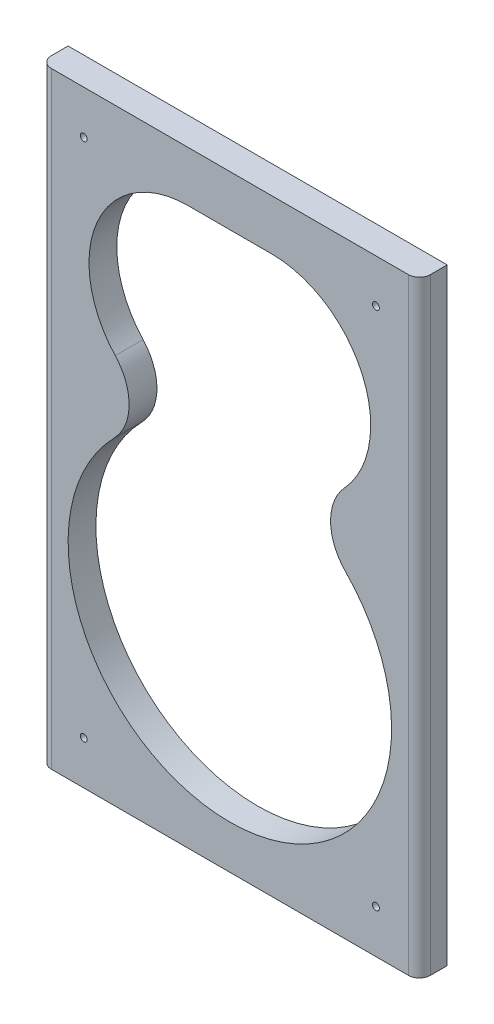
ISO-10303-21;
HEADER;
FILE_DESCRIPTION(('STEP AP214'),'2;1');
FILE_NAME('part.step','',(''),(''),'','','');
FILE_SCHEMA(('AUTOMOTIVE_DESIGN { 1 0 10303 214 1 1 1 1 }'));
ENDSEC;
DATA;
#1=APPLICATION_CONTEXT('core data for automotive mechanical design processes');
#2=APPLICATION_PROTOCOL_DEFINITION('international standard','automotive_design',2000,#1);
#3=PRODUCT_CONTEXT('',#1,'mechanical');
#4=PRODUCT('Part','Part','',(#3));
#5=PRODUCT_RELATED_PRODUCT_CATEGORY('part','',(#4));
#6=PRODUCT_DEFINITION_FORMATION('','',#4);
#7=PRODUCT_DEFINITION_CONTEXT('part definition',#1,'design');
#8=PRODUCT_DEFINITION('design','',#6,#7);
#9=PRODUCT_DEFINITION_SHAPE('','',#8);
#10=(LENGTH_UNIT() NAMED_UNIT(*) SI_UNIT(.MILLI.,.METRE.));
#11=(NAMED_UNIT(*) PLANE_ANGLE_UNIT() SI_UNIT($,.RADIAN.));
#12=(NAMED_UNIT(*) SI_UNIT($,.STERADIAN.) SOLID_ANGLE_UNIT());
#13=UNCERTAINTY_MEASURE_WITH_UNIT(LENGTH_MEASURE(1.E-05),#10,'distance_accuracy_value','');
#14=(GEOMETRIC_REPRESENTATION_CONTEXT(3) GLOBAL_UNCERTAINTY_ASSIGNED_CONTEXT((#13)) GLOBAL_UNIT_ASSIGNED_CONTEXT((#10,
#11,#12)) REPRESENTATION_CONTEXT('',''));
#15=CARTESIAN_POINT('',(0.,0.,0.));
#16=DIRECTION('',(0.,0.,1.));
#17=DIRECTION('',(1.,0.,0.));
#18=AXIS2_PLACEMENT_3D('',#15,#16,#17);
#19=CARTESIAN_POINT('',(11.,365.,16.));
#20=DIRECTION('',(0.,0.,-1.));
#21=DIRECTION('',(-1.,0.,0.));
#22=AXIS2_PLACEMENT_3D('',#19,#20,#21);
#23=PLANE('',#22);
#24=CARTESIAN_POINT('',(36.,41.0000000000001,16.));
#25=DIRECTION('',(0.,0.,-1.));
#26=DIRECTION('',(-1.,0.,0.));
#27=AXIS2_PLACEMENT_3D('',#24,#25,#26);
#28=CIRCLE('',#27,2.);
#29=CARTESIAN_POINT('',(34.,41.0000000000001,16.));
#30=VERTEX_POINT('',#29);
#31=EDGE_CURVE('E298',#30,#30,#28,.T.);
#32=ORIENTED_EDGE('',*,*,#31,.T.);
#33=EDGE_LOOP('',(#32));
#34=FACE_BOUND('',#33,.T.);
#35=CARTESIAN_POINT('',(204.,41.0000000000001,16.));
#36=DIRECTION('',(0.,0.,-1.));
#37=DIRECTION('',(-1.,0.,0.));
#38=AXIS2_PLACEMENT_3D('',#35,#36,#37);
#39=CIRCLE('',#38,2.);
#40=CARTESIAN_POINT('',(202.,41.0000000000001,16.));
#41=VERTEX_POINT('',#40);
#42=EDGE_CURVE('E306',#41,#41,#39,.T.);
#43=ORIENTED_EDGE('',*,*,#42,.T.);
#44=EDGE_LOOP('',(#43));
#45=FACE_BOUND('',#44,.T.);
#46=CARTESIAN_POINT('',(36.,340.,16.));
#47=DIRECTION('',(0.,0.,-1.));
#48=DIRECTION('',(-1.,0.,0.));
#49=AXIS2_PLACEMENT_3D('',#46,#47,#48);
#50=CIRCLE('',#49,2.);
#51=CARTESIAN_POINT('',(34.,340.,16.));
#52=VERTEX_POINT('',#51);
#53=EDGE_CURVE('E312',#52,#52,#50,.T.);
#54=ORIENTED_EDGE('',*,*,#53,.T.);
#55=EDGE_LOOP('',(#54));
#56=FACE_BOUND('',#55,.T.);
#57=CARTESIAN_POINT('',(204.,340.,16.));
#58=DIRECTION('',(0.,0.,-1.));
#59=DIRECTION('',(-1.,0.,0.));
#60=AXIS2_PLACEMENT_3D('',#57,#58,#59);
#61=CIRCLE('',#60,2.);
#62=CARTESIAN_POINT('',(202.,340.,16.));
#63=VERTEX_POINT('',#62);
#64=EDGE_CURVE('E158',#63,#63,#61,.T.);
#65=ORIENTED_EDGE('',*,*,#64,.T.);
#66=EDGE_LOOP('',(#65));
#67=FACE_BOUND('',#66,.T.);
#68=DIRECTION('',(-1.,0.,0.));
#69=VECTOR('',#68,1.);
#70=CARTESIAN_POINT('',(11.,365.,16.));
#71=LINE('',#70,#69);
#72=CARTESIAN_POINT('',(222.65,365.,16.));
#73=VERTEX_POINT('',#72);
#74=CARTESIAN_POINT('',(17.35,365.,16.));
#75=VERTEX_POINT('',#74);
#76=EDGE_CURVE('E182',#73,#75,#71,.T.);
#77=ORIENTED_EDGE('',*,*,#76,.T.);
#78=DIRECTION('',(0.,-1.,0.));
#79=VECTOR('',#78,1.);
#80=CARTESIAN_POINT('',(17.35,365.,16.));
#81=LINE('',#80,#79);
#82=CARTESIAN_POINT('',(17.35,16.0000000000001,16.));
#83=VERTEX_POINT('',#82);
#84=EDGE_CURVE('E207',#75,#83,#81,.T.);
#85=ORIENTED_EDGE('',*,*,#84,.T.);
#86=DIRECTION('',(1.,0.,0.));
#87=VECTOR('',#86,1.);
#88=CARTESIAN_POINT('',(229.,16.0000000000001,16.));
#89=LINE('',#88,#87);
#90=CARTESIAN_POINT('',(222.65,16.0000000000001,16.));
#91=VERTEX_POINT('',#90);
#92=EDGE_CURVE('E179',#83,#91,#89,.T.);
#93=ORIENTED_EDGE('',*,*,#92,.T.);
#94=DIRECTION('',(0.,1.,0.));
#95=VECTOR('',#94,1.);
#96=CARTESIAN_POINT('',(222.65,365.,16.));
#97=LINE('',#96,#95);
#98=EDGE_CURVE('E204',#91,#73,#97,.T.);
#99=ORIENTED_EDGE('',*,*,#98,.T.);
#100=EDGE_LOOP('',(#77,#85,#93,#99));
#101=FACE_BOUND('',#100,.T.);
#102=CARTESIAN_POINT('',(120.,134.002673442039,16.));
#103=DIRECTION('',(0.,0.,1.));
#104=DIRECTION('',(1.,0.,0.));
#105=AXIS2_PLACEMENT_3D('',#102,#103,#104);
#106=CIRCLE('',#105,93.);
#107=CARTESIAN_POINT('',(53.5106907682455,199.027067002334,16.));
#108=VERTEX_POINT('',#107);
#109=CARTESIAN_POINT('',(186.489309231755,199.027067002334,16.));
#110=VERTEX_POINT('',#109);
#111=EDGE_CURVE('E121',#108,#110,#106,.T.);
#112=ORIENTED_EDGE('',*,*,#111,.F.);
#113=CARTESIAN_POINT('',(32.0625264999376,220.002677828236,16.));
#114=DIRECTION('',(0.,0.,-1.));
#115=DIRECTION('',(1.,0.,0.));
#116=AXIS2_PLACEMENT_3D('',#113,#114,#115);
#117=CIRCLE('',#116,30.);
#118=CARTESIAN_POINT('',(54.1099311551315,240.347503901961,16.));
#119=VERTEX_POINT('',#118);
#120=EDGE_CURVE('E154',#119,#108,#117,.T.);
#121=ORIENTED_EDGE('',*,*,#120,.F.);
#122=CARTESIAN_POINT('',(96.,279.002673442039,16.));
#123=DIRECTION('',(0.,0.,1.));
#124=DIRECTION('',(1.,0.,0.));
#125=AXIS2_PLACEMENT_3D('',#122,#123,#124);
#126=CIRCLE('',#125,57.);
#127=CARTESIAN_POINT('',(96.,336.002673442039,16.));
#128=VERTEX_POINT('',#127);
#129=EDGE_CURVE('E151',#128,#119,#126,.T.);
#130=ORIENTED_EDGE('',*,*,#129,.F.);
#131=DIRECTION('',(-1.,0.,0.));
#132=VECTOR('',#131,1.);
#133=CARTESIAN_POINT('',(96.,336.002673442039,16.));
#134=LINE('',#133,#132);
#135=CARTESIAN_POINT('',(144.,336.002673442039,16.));
#136=VERTEX_POINT('',#135);
#137=EDGE_CURVE('E146',#136,#128,#134,.T.);
#138=ORIENTED_EDGE('',*,*,#137,.F.);
#139=CARTESIAN_POINT('',(144.,279.002673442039,16.));
#140=DIRECTION('',(0.,0.,1.));
#141=DIRECTION('',(1.,0.,0.));
#142=AXIS2_PLACEMENT_3D('',#139,#140,#141);
#143=CIRCLE('',#142,57.);
#144=CARTESIAN_POINT('',(185.890068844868,240.347503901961,16.));
#145=VERTEX_POINT('',#144);
#146=EDGE_CURVE('E144',#145,#136,#143,.T.);
#147=ORIENTED_EDGE('',*,*,#146,.F.);
#148=CARTESIAN_POINT('',(207.937473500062,220.002677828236,16.));
#149=DIRECTION('',(0.,0.,-1.));
#150=DIRECTION('',(-1.,0.,0.));
#151=AXIS2_PLACEMENT_3D('',#148,#149,#150);
#152=CIRCLE('',#151,30.);
#153=EDGE_CURVE('E131',#110,#145,#152,.T.);
#154=ORIENTED_EDGE('',*,*,#153,.F.);
#155=EDGE_LOOP('',(#112,#121,#130,#138,#147,#154));
#156=FACE_BOUND('',#155,.T.);
#157=ADVANCED_FACE('F31',(#34,#45,#56,#67,#101,#156),#23,.F.);
#158=CARTESIAN_POINT('',(11.,365.,0.));
#159=DIRECTION('',(0.,0.,-1.));
#160=DIRECTION('',(-1.,0.,0.));
#161=AXIS2_PLACEMENT_3D('',#158,#159,#160);
#162=PLANE('',#161);
#163=CARTESIAN_POINT('',(36.,41.0000000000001,0.));
#164=DIRECTION('',(0.,0.,-1.));
#165=DIRECTION('',(-1.,0.,0.));
#166=AXIS2_PLACEMENT_3D('',#163,#164,#165);
#167=CIRCLE('',#166,2.);
#168=CARTESIAN_POINT('',(34.,41.0000000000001,0.));
#169=VERTEX_POINT('',#168);
#170=EDGE_CURVE('E301',#169,#169,#167,.T.);
#171=ORIENTED_EDGE('',*,*,#170,.F.);
#172=EDGE_LOOP('',(#171));
#173=FACE_BOUND('',#172,.T.);
#174=CARTESIAN_POINT('',(204.,41.0000000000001,0.));
#175=DIRECTION('',(0.,0.,-1.));
#176=DIRECTION('',(-1.,0.,0.));
#177=AXIS2_PLACEMENT_3D('',#174,#175,#176);
#178=CIRCLE('',#177,2.);
#179=CARTESIAN_POINT('',(202.,41.0000000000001,0.));
#180=VERTEX_POINT('',#179);
#181=EDGE_CURVE('E303',#180,#180,#178,.T.);
#182=ORIENTED_EDGE('',*,*,#181,.F.);
#183=EDGE_LOOP('',(#182));
#184=FACE_BOUND('',#183,.T.);
#185=CARTESIAN_POINT('',(36.,340.,0.));
#186=DIRECTION('',(0.,0.,-1.));
#187=DIRECTION('',(-1.,0.,0.));
#188=AXIS2_PLACEMENT_3D('',#185,#186,#187);
#189=CIRCLE('',#188,2.);
#190=CARTESIAN_POINT('',(34.,340.,0.));
#191=VERTEX_POINT('',#190);
#192=EDGE_CURVE('E309',#191,#191,#189,.T.);
#193=ORIENTED_EDGE('',*,*,#192,.F.);
#194=EDGE_LOOP('',(#193));
#195=FACE_BOUND('',#194,.T.);
#196=CARTESIAN_POINT('',(204.,340.,0.));
#197=DIRECTION('',(0.,0.,-1.));
#198=DIRECTION('',(-1.,0.,0.));
#199=AXIS2_PLACEMENT_3D('',#196,#197,#198);
#200=CIRCLE('',#199,2.);
#201=CARTESIAN_POINT('',(202.,340.,0.));
#202=VERTEX_POINT('',#201);
#203=EDGE_CURVE('E315',#202,#202,#200,.T.);
#204=ORIENTED_EDGE('',*,*,#203,.F.);
#205=EDGE_LOOP('',(#204));
#206=FACE_BOUND('',#205,.T.);
#207=DIRECTION('',(0.,-1.,0.));
#208=VECTOR('',#207,1.);
#209=CARTESIAN_POINT('',(11.,16.0000000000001,0.));
#210=LINE('',#209,#208);
#211=CARTESIAN_POINT('',(11.,365.,0.));
#212=VERTEX_POINT('',#211);
#213=CARTESIAN_POINT('',(11.,16.0000000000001,0.));
#214=VERTEX_POINT('',#213);
#215=EDGE_CURVE('E139',#212,#214,#210,.T.);
#216=ORIENTED_EDGE('',*,*,#215,.F.);
#217=DIRECTION('',(-1.,0.,0.));
#218=VECTOR('',#217,1.);
#219=CARTESIAN_POINT('',(11.,365.,0.));
#220=LINE('',#219,#218);
#221=CARTESIAN_POINT('',(229.,365.,0.));
#222=VERTEX_POINT('',#221);
#223=EDGE_CURVE('E183',#222,#212,#220,.T.);
#224=ORIENTED_EDGE('',*,*,#223,.F.);
#225=DIRECTION('',(0.,1.,0.));
#226=VECTOR('',#225,1.);
#227=CARTESIAN_POINT('',(229.,365.,0.));
#228=LINE('',#227,#226);
#229=CARTESIAN_POINT('',(229.,16.0000000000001,0.));
#230=VERTEX_POINT('',#229);
#231=EDGE_CURVE('E192',#230,#222,#228,.T.);
#232=ORIENTED_EDGE('',*,*,#231,.F.);
#233=DIRECTION('',(1.,0.,0.));
#234=VECTOR('',#233,1.);
#235=CARTESIAN_POINT('',(229.,16.0000000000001,0.));
#236=LINE('',#235,#234);
#237=EDGE_CURVE('E189',#214,#230,#236,.T.);
#238=ORIENTED_EDGE('',*,*,#237,.F.);
#239=EDGE_LOOP('',(#216,#224,#232,#238));
#240=FACE_BOUND('',#239,.T.);
#241=CARTESIAN_POINT('',(32.0625264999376,220.002677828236,0.));
#242=DIRECTION('',(0.,0.,-1.));
#243=DIRECTION('',(1.,0.,0.));
#244=AXIS2_PLACEMENT_3D('',#241,#242,#243);
#245=CIRCLE('',#244,30.);
#246=CARTESIAN_POINT('',(54.1099311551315,240.347503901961,0.));
#247=VERTEX_POINT('',#246);
#248=CARTESIAN_POINT('',(53.5106907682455,199.027067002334,0.));
#249=VERTEX_POINT('',#248);
#250=EDGE_CURVE('E132',#247,#249,#245,.T.);
#251=ORIENTED_EDGE('',*,*,#250,.T.);
#252=CARTESIAN_POINT('',(120.,134.002673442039,0.));
#253=DIRECTION('',(0.,0.,1.));
#254=DIRECTION('',(1.,0.,0.));
#255=AXIS2_PLACEMENT_3D('',#252,#253,#254);
#256=CIRCLE('',#255,93.);
#257=CARTESIAN_POINT('',(186.489309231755,199.027067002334,0.));
#258=VERTEX_POINT('',#257);
#259=EDGE_CURVE('E156',#249,#258,#256,.T.);
#260=ORIENTED_EDGE('',*,*,#259,.T.);
#261=CARTESIAN_POINT('',(207.937473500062,220.002677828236,0.));
#262=DIRECTION('',(0.,0.,-1.));
#263=DIRECTION('',(-1.,0.,0.));
#264=AXIS2_PLACEMENT_3D('',#261,#262,#263);
#265=CIRCLE('',#264,30.);
#266=CARTESIAN_POINT('',(185.890068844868,240.347503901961,0.));
#267=VERTEX_POINT('',#266);
#268=EDGE_CURVE('E138',#258,#267,#265,.T.);
#269=ORIENTED_EDGE('',*,*,#268,.T.);
#270=CARTESIAN_POINT('',(144.,279.002673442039,0.));
#271=DIRECTION('',(0.,0.,1.));
#272=DIRECTION('',(1.,0.,0.));
#273=AXIS2_PLACEMENT_3D('',#270,#271,#272);
#274=CIRCLE('',#273,57.);
#275=CARTESIAN_POINT('',(144.,336.002673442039,0.));
#276=VERTEX_POINT('',#275);
#277=EDGE_CURVE('E160',#267,#276,#274,.T.);
#278=ORIENTED_EDGE('',*,*,#277,.T.);
#279=DIRECTION('',(-1.,0.,0.));
#280=VECTOR('',#279,1.);
#281=CARTESIAN_POINT('',(96.,336.002673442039,0.));
#282=LINE('',#281,#280);
#283=CARTESIAN_POINT('',(96.,336.002673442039,0.));
#284=VERTEX_POINT('',#283);
#285=EDGE_CURVE('E163',#276,#284,#282,.T.);
#286=ORIENTED_EDGE('',*,*,#285,.T.);
#287=CARTESIAN_POINT('',(96.,279.002673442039,0.));
#288=DIRECTION('',(0.,0.,1.));
#289=DIRECTION('',(1.,0.,0.));
#290=AXIS2_PLACEMENT_3D('',#287,#288,#289);
#291=CIRCLE('',#290,57.);
#292=EDGE_CURVE('E166',#284,#247,#291,.T.);
#293=ORIENTED_EDGE('',*,*,#292,.T.);
#294=EDGE_LOOP('',(#251,#260,#269,#278,#286,#293));
#295=FACE_BOUND('',#294,.T.);
#296=ADVANCED_FACE('F230',(#173,#184,#195,#206,#240,#295),#162,.T.);
#297=CARTESIAN_POINT('',(11.,16.0000000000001,16.));
#298=DIRECTION('',(1.,0.,0.));
#299=DIRECTION('',(0.,0.,-1.));
#300=AXIS2_PLACEMENT_3D('',#297,#298,#299);
#301=PLANE('',#300);
#302=DIRECTION('',(0.,0.,-1.));
#303=VECTOR('',#302,1.);
#304=CARTESIAN_POINT('',(11.,16.0000000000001,16.));
#305=LINE('',#304,#303);
#306=CARTESIAN_POINT('',(11.,16.0000000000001,9.65));
#307=VERTEX_POINT('',#306);
#308=EDGE_CURVE('E202',#307,#214,#305,.T.);
#309=ORIENTED_EDGE('',*,*,#308,.F.);
#310=DIRECTION('',(0.,-1.,0.));
#311=VECTOR('',#310,1.);
#312=CARTESIAN_POINT('',(11.,16.0000000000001,9.65));
#313=LINE('',#312,#311);
#314=CARTESIAN_POINT('',(11.,365.,9.65));
#315=VERTEX_POINT('',#314);
#316=EDGE_CURVE('E54',#307,#315,#313,.F.);
#317=ORIENTED_EDGE('',*,*,#316,.T.);
#318=DIRECTION('',(0.,0.,-1.));
#319=VECTOR('',#318,1.);
#320=CARTESIAN_POINT('',(11.,365.,16.));
#321=LINE('',#320,#319);
#322=EDGE_CURVE('E186',#315,#212,#321,.T.);
#323=ORIENTED_EDGE('',*,*,#322,.T.);
#324=ORIENTED_EDGE('',*,*,#215,.T.);
#325=EDGE_LOOP('',(#309,#317,#323,#324));
#326=FACE_BOUND('',#325,.T.);
#327=ADVANCED_FACE('F226',(#326),#301,.F.);
#328=CARTESIAN_POINT('',(229.,16.0000000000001,16.));
#329=DIRECTION('',(0.,1.,0.));
#330=DIRECTION('',(0.,0.,1.));
#331=AXIS2_PLACEMENT_3D('',#328,#329,#330);
#332=PLANE('',#331);
#333=ORIENTED_EDGE('',*,*,#92,.F.);
#334=CARTESIAN_POINT('',(17.35,16.0000000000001,9.65));
#335=DIRECTION('',(0.,1.,0.));
#336=DIRECTION('',(0.,0.,1.));
#337=AXIS2_PLACEMENT_3D('',#334,#335,#336);
#338=CIRCLE('',#337,6.35);
#339=EDGE_CURVE('E212',#83,#307,#338,.F.);
#340=ORIENTED_EDGE('',*,*,#339,.T.);
#341=ORIENTED_EDGE('',*,*,#308,.T.);
#342=ORIENTED_EDGE('',*,*,#237,.T.);
#343=DIRECTION('',(0.,0.,-1.));
#344=VECTOR('',#343,1.);
#345=CARTESIAN_POINT('',(229.,16.0000000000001,16.));
#346=LINE('',#345,#344);
#347=CARTESIAN_POINT('',(229.,16.0000000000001,9.65));
#348=VERTEX_POINT('',#347);
#349=EDGE_CURVE('E200',#348,#230,#346,.T.);
#350=ORIENTED_EDGE('',*,*,#349,.F.);
#351=CARTESIAN_POINT('',(222.65,16.0000000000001,9.65));
#352=DIRECTION('',(0.,1.,0.));
#353=DIRECTION('',(0.,0.,1.));
#354=AXIS2_PLACEMENT_3D('',#351,#352,#353);
#355=CIRCLE('',#354,6.35);
#356=EDGE_CURVE('E210',#348,#91,#355,.F.);
#357=ORIENTED_EDGE('',*,*,#356,.T.);
#358=EDGE_LOOP('',(#333,#340,#341,#342,#350,#357));
#359=FACE_BOUND('',#358,.T.);
#360=ADVANCED_FACE('F224',(#359),#332,.F.);
#361=CARTESIAN_POINT('',(229.,365.,16.));
#362=DIRECTION('',(-1.,0.,0.));
#363=DIRECTION('',(0.,0.,1.));
#364=AXIS2_PLACEMENT_3D('',#361,#362,#363);
#365=PLANE('',#364);
#366=DIRECTION('',(0.,0.,-1.));
#367=VECTOR('',#366,1.);
#368=CARTESIAN_POINT('',(229.,365.,16.));
#369=LINE('',#368,#367);
#370=CARTESIAN_POINT('',(229.,365.,9.65));
#371=VERTEX_POINT('',#370);
#372=EDGE_CURVE('E198',#371,#222,#369,.T.);
#373=ORIENTED_EDGE('',*,*,#372,.F.);
#374=DIRECTION('',(0.,1.,0.));
#375=VECTOR('',#374,1.);
#376=CARTESIAN_POINT('',(229.,365.,9.65));
#377=LINE('',#376,#375);
#378=EDGE_CURVE('E11',#371,#348,#377,.F.);
#379=ORIENTED_EDGE('',*,*,#378,.T.);
#380=ORIENTED_EDGE('',*,*,#349,.T.);
#381=ORIENTED_EDGE('',*,*,#231,.T.);
#382=EDGE_LOOP('',(#373,#379,#380,#381));
#383=FACE_BOUND('',#382,.T.);
#384=ADVANCED_FACE('F238',(#383),#365,.F.);
#385=CARTESIAN_POINT('',(11.,365.,16.));
#386=DIRECTION('',(0.,-1.,0.));
#387=DIRECTION('',(0.,0.,-1.));
#388=AXIS2_PLACEMENT_3D('',#385,#386,#387);
#389=PLANE('',#388);
#390=ORIENTED_EDGE('',*,*,#322,.F.);
#391=CARTESIAN_POINT('',(17.35,365.,9.65));
#392=DIRECTION('',(0.,-1.,0.));
#393=DIRECTION('',(0.,0.,-1.));
#394=AXIS2_PLACEMENT_3D('',#391,#392,#393);
#395=CIRCLE('',#394,6.35);
#396=EDGE_CURVE('E39',#315,#75,#395,.F.);
#397=ORIENTED_EDGE('',*,*,#396,.T.);
#398=ORIENTED_EDGE('',*,*,#76,.F.);
#399=CARTESIAN_POINT('',(222.65,365.,9.65));
#400=DIRECTION('',(0.,-1.,0.));
#401=DIRECTION('',(0.,0.,-1.));
#402=AXIS2_PLACEMENT_3D('',#399,#400,#401);
#403=CIRCLE('',#402,6.35);
#404=EDGE_CURVE('E46',#73,#371,#403,.F.);
#405=ORIENTED_EDGE('',*,*,#404,.T.);
#406=ORIENTED_EDGE('',*,*,#372,.T.);
#407=ORIENTED_EDGE('',*,*,#223,.T.);
#408=EDGE_LOOP('',(#390,#397,#398,#405,#406,#407));
#409=FACE_BOUND('',#408,.T.);
#410=ADVANCED_FACE('F216',(#409),#389,.F.);
#411=CARTESIAN_POINT('',(120.,134.002673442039,16.));
#412=DIRECTION('',(0.,0.,-1.));
#413=DIRECTION('',(-1.,0.,0.));
#414=AXIS2_PLACEMENT_3D('',#411,#412,#413);
#415=CYLINDRICAL_SURFACE('',#414,93.);
#416=ORIENTED_EDGE('',*,*,#259,.F.);
#417=DIRECTION('',(0.,0.,-1.));
#418=VECTOR('',#417,1.);
#419=CARTESIAN_POINT('',(53.5106907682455,199.027067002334,16.));
#420=LINE('',#419,#418);
#421=EDGE_CURVE('E127',#108,#249,#420,.T.);
#422=ORIENTED_EDGE('',*,*,#421,.F.);
#423=ORIENTED_EDGE('',*,*,#111,.T.);
#424=DIRECTION('',(0.,0.,-1.));
#425=VECTOR('',#424,1.);
#426=CARTESIAN_POINT('',(186.489309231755,199.027067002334,16.));
#427=LINE('',#426,#425);
#428=EDGE_CURVE('E124',#110,#258,#427,.T.);
#429=ORIENTED_EDGE('',*,*,#428,.T.);
#430=EDGE_LOOP('',(#416,#422,#423,#429));
#431=FACE_BOUND('',#430,.T.);
#432=ADVANCED_FACE('F123',(#431),#415,.F.);
#433=CARTESIAN_POINT('',(207.937473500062,220.002677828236,16.));
#434=DIRECTION('',(0.,0.,-1.));
#435=DIRECTION('',(-1.,0.,0.));
#436=AXIS2_PLACEMENT_3D('',#433,#434,#435);
#437=CYLINDRICAL_SURFACE('',#436,30.);
#438=ORIENTED_EDGE('',*,*,#268,.F.);
#439=ORIENTED_EDGE('',*,*,#428,.F.);
#440=ORIENTED_EDGE('',*,*,#153,.T.);
#441=DIRECTION('',(0.,0.,-1.));
#442=VECTOR('',#441,1.);
#443=CARTESIAN_POINT('',(185.890068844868,240.347503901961,16.));
#444=LINE('',#443,#442);
#445=EDGE_CURVE('E140',#145,#267,#444,.T.);
#446=ORIENTED_EDGE('',*,*,#445,.T.);
#447=EDGE_LOOP('',(#438,#439,#440,#446));
#448=FACE_BOUND('',#447,.T.);
#449=ADVANCED_FACE('F135',(#448),#437,.T.);
#450=CARTESIAN_POINT('',(144.,279.002673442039,16.));
#451=DIRECTION('',(0.,0.,-1.));
#452=DIRECTION('',(-1.,0.,0.));
#453=AXIS2_PLACEMENT_3D('',#450,#451,#452);
#454=CYLINDRICAL_SURFACE('',#453,57.);
#455=ORIENTED_EDGE('',*,*,#277,.F.);
#456=ORIENTED_EDGE('',*,*,#445,.F.);
#457=ORIENTED_EDGE('',*,*,#146,.T.);
#458=DIRECTION('',(0.,0.,-1.));
#459=VECTOR('',#458,1.);
#460=CARTESIAN_POINT('',(144.,336.002673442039,16.));
#461=LINE('',#460,#459);
#462=EDGE_CURVE('E176',#136,#276,#461,.T.);
#463=ORIENTED_EDGE('',*,*,#462,.T.);
#464=EDGE_LOOP('',(#455,#456,#457,#463));
#465=FACE_BOUND('',#464,.T.);
#466=ADVANCED_FACE('F263',(#465),#454,.F.);
#467=CARTESIAN_POINT('',(96.,336.002673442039,16.));
#468=DIRECTION('',(0.,-1.,0.));
#469=DIRECTION('',(0.,0.,-1.));
#470=AXIS2_PLACEMENT_3D('',#467,#468,#469);
#471=PLANE('',#470);
#472=ORIENTED_EDGE('',*,*,#285,.F.);
#473=ORIENTED_EDGE('',*,*,#462,.F.);
#474=ORIENTED_EDGE('',*,*,#137,.T.);
#475=DIRECTION('',(0.,0.,-1.));
#476=VECTOR('',#475,1.);
#477=CARTESIAN_POINT('',(96.,336.002673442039,16.));
#478=LINE('',#477,#476);
#479=EDGE_CURVE('E174',#128,#284,#478,.T.);
#480=ORIENTED_EDGE('',*,*,#479,.T.);
#481=EDGE_LOOP('',(#472,#473,#474,#480));
#482=FACE_BOUND('',#481,.T.);
#483=ADVANCED_FACE('F266',(#482),#471,.T.);
#484=CARTESIAN_POINT('',(96.,279.002673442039,16.));
#485=DIRECTION('',(0.,0.,-1.));
#486=DIRECTION('',(-1.,0.,0.));
#487=AXIS2_PLACEMENT_3D('',#484,#485,#486);
#488=CYLINDRICAL_SURFACE('',#487,57.);
#489=ORIENTED_EDGE('',*,*,#292,.F.);
#490=ORIENTED_EDGE('',*,*,#479,.F.);
#491=ORIENTED_EDGE('',*,*,#129,.T.);
#492=DIRECTION('',(0.,0.,-1.));
#493=VECTOR('',#492,1.);
#494=CARTESIAN_POINT('',(54.1099311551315,240.347503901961,16.));
#495=LINE('',#494,#493);
#496=EDGE_CURVE('E172',#119,#247,#495,.T.);
#497=ORIENTED_EDGE('',*,*,#496,.T.);
#498=EDGE_LOOP('',(#489,#490,#491,#497));
#499=FACE_BOUND('',#498,.T.);
#500=ADVANCED_FACE('F270',(#499),#488,.F.);
#501=CARTESIAN_POINT('',(32.0625264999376,220.002677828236,16.));
#502=DIRECTION('',(0.,0.,-1.));
#503=DIRECTION('',(-1.,0.,0.));
#504=AXIS2_PLACEMENT_3D('',#501,#502,#503);
#505=CYLINDRICAL_SURFACE('',#504,30.);
#506=ORIENTED_EDGE('',*,*,#250,.F.);
#507=ORIENTED_EDGE('',*,*,#496,.F.);
#508=ORIENTED_EDGE('',*,*,#120,.T.);
#509=ORIENTED_EDGE('',*,*,#421,.T.);
#510=EDGE_LOOP('',(#506,#507,#508,#509));
#511=FACE_BOUND('',#510,.T.);
#512=ADVANCED_FACE('F274',(#511),#505,.T.);
#513=CARTESIAN_POINT('',(17.35,365.,9.65));
#514=DIRECTION('',(0.,-1.,0.));
#515=DIRECTION('',(0.,0.,-1.));
#516=AXIS2_PLACEMENT_3D('',#513,#514,#515);
#517=CYLINDRICAL_SURFACE('',#516,6.35);
#518=ORIENTED_EDGE('',*,*,#396,.F.);
#519=ORIENTED_EDGE('',*,*,#316,.F.);
#520=ORIENTED_EDGE('',*,*,#339,.F.);
#521=ORIENTED_EDGE('',*,*,#84,.F.);
#522=EDGE_LOOP('',(#518,#519,#520,#521));
#523=FACE_BOUND('',#522,.T.);
#524=ADVANCED_FACE('F222',(#523),#517,.T.);
#525=CARTESIAN_POINT('',(222.65,365.,9.65));
#526=DIRECTION('',(0.,1.,0.));
#527=DIRECTION('',(0.,0.,1.));
#528=AXIS2_PLACEMENT_3D('',#525,#526,#527);
#529=CYLINDRICAL_SURFACE('',#528,6.35);
#530=ORIENTED_EDGE('',*,*,#356,.F.);
#531=ORIENTED_EDGE('',*,*,#378,.F.);
#532=ORIENTED_EDGE('',*,*,#404,.F.);
#533=ORIENTED_EDGE('',*,*,#98,.F.);
#534=EDGE_LOOP('',(#530,#531,#532,#533));
#535=FACE_BOUND('',#534,.T.);
#536=ADVANCED_FACE('F33',(#535),#529,.T.);
#537=CARTESIAN_POINT('',(204.,340.,16.));
#538=DIRECTION('',(0.,0.,-1.));
#539=DIRECTION('',(-1.,0.,0.));
#540=AXIS2_PLACEMENT_3D('',#537,#538,#539);
#541=CYLINDRICAL_SURFACE('',#540,2.);
#542=ORIENTED_EDGE('',*,*,#64,.F.);
#543=EDGE_LOOP('',(#542));
#544=FACE_BOUND('',#543,.T.);
#545=ORIENTED_EDGE('',*,*,#203,.T.);
#546=EDGE_LOOP('',(#545));
#547=FACE_BOUND('',#546,.T.);
#548=ADVANCED_FACE('F279',(#544,#547),#541,.F.);
#549=CARTESIAN_POINT('',(36.,340.,16.));
#550=DIRECTION('',(0.,0.,-1.));
#551=DIRECTION('',(-1.,0.,0.));
#552=AXIS2_PLACEMENT_3D('',#549,#550,#551);
#553=CYLINDRICAL_SURFACE('',#552,2.);
#554=ORIENTED_EDGE('',*,*,#53,.F.);
#555=EDGE_LOOP('',(#554));
#556=FACE_BOUND('',#555,.T.);
#557=ORIENTED_EDGE('',*,*,#192,.T.);
#558=EDGE_LOOP('',(#557));
#559=FACE_BOUND('',#558,.T.);
#560=ADVANCED_FACE('F282',(#556,#559),#553,.F.);
#561=CARTESIAN_POINT('',(204.,41.0000000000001,16.));
#562=DIRECTION('',(0.,0.,-1.));
#563=DIRECTION('',(-1.,0.,0.));
#564=AXIS2_PLACEMENT_3D('',#561,#562,#563);
#565=CYLINDRICAL_SURFACE('',#564,2.);
#566=ORIENTED_EDGE('',*,*,#42,.F.);
#567=EDGE_LOOP('',(#566));
#568=FACE_BOUND('',#567,.T.);
#569=ORIENTED_EDGE('',*,*,#181,.T.);
#570=EDGE_LOOP('',(#569));
#571=FACE_BOUND('',#570,.T.);
#572=ADVANCED_FACE('F286',(#568,#571),#565,.F.);
#573=CARTESIAN_POINT('',(36.,41.0000000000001,16.));
#574=DIRECTION('',(0.,0.,-1.));
#575=DIRECTION('',(-1.,0.,0.));
#576=AXIS2_PLACEMENT_3D('',#573,#574,#575);
#577=CYLINDRICAL_SURFACE('',#576,2.);
#578=ORIENTED_EDGE('',*,*,#31,.F.);
#579=EDGE_LOOP('',(#578));
#580=FACE_BOUND('',#579,.T.);
#581=ORIENTED_EDGE('',*,*,#170,.T.);
#582=EDGE_LOOP('',(#581));
#583=FACE_BOUND('',#582,.T.);
#584=ADVANCED_FACE('F290',(#580,#583),#577,.F.);
#585=CLOSED_SHELL('',(#157,#296,#327,#360,#384,#410,#432,#449,#466,#483,#500,#512,#524,#536,
#548,#560,#572,#584));
#586=MANIFOLD_SOLID_BREP('B2',#585);
#587=ADVANCED_BREP_SHAPE_REPRESENTATION('',(#18,#586),#14);
#588=SHAPE_DEFINITION_REPRESENTATION(#9,#587);
ENDSEC;
END-ISO-10303-21;
